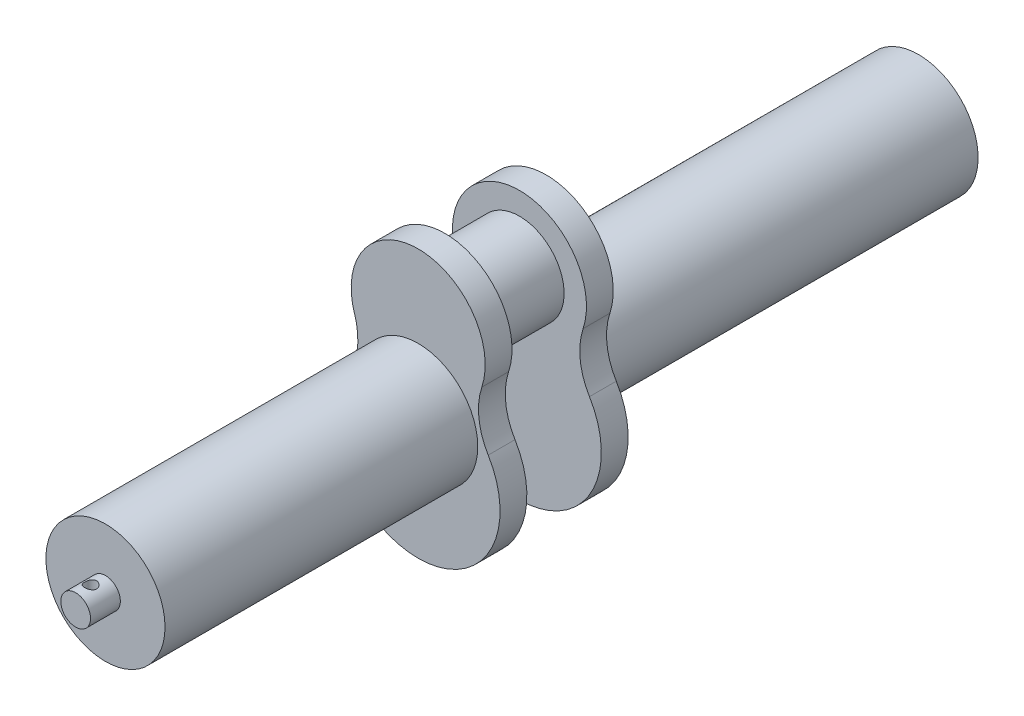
ISO-10303-21;
HEADER;
FILE_DESCRIPTION(('STEP AP214'),'2;1');
FILE_NAME('part.step','',(''),(''),'','','');
FILE_SCHEMA(('AUTOMOTIVE_DESIGN { 1 0 10303 214 1 1 1 1 }'));
ENDSEC;
DATA;
#1=APPLICATION_CONTEXT('core data for automotive mechanical design processes');
#2=APPLICATION_PROTOCOL_DEFINITION('international standard','automotive_design',2000,#1);
#3=PRODUCT_CONTEXT('',#1,'mechanical');
#4=PRODUCT('Part','Part','',(#3));
#5=PRODUCT_RELATED_PRODUCT_CATEGORY('part','',(#4));
#6=PRODUCT_DEFINITION_FORMATION('','',#4);
#7=PRODUCT_DEFINITION_CONTEXT('part definition',#1,'design');
#8=PRODUCT_DEFINITION('design','',#6,#7);
#9=PRODUCT_DEFINITION_SHAPE('','',#8);
#10=(LENGTH_UNIT() NAMED_UNIT(*) SI_UNIT(.MILLI.,.METRE.));
#11=(NAMED_UNIT(*) PLANE_ANGLE_UNIT() SI_UNIT($,.RADIAN.));
#12=(NAMED_UNIT(*) SI_UNIT($,.STERADIAN.) SOLID_ANGLE_UNIT());
#13=UNCERTAINTY_MEASURE_WITH_UNIT(LENGTH_MEASURE(1.E-05),#10,'distance_accuracy_value','');
#14=(GEOMETRIC_REPRESENTATION_CONTEXT(3) GLOBAL_UNCERTAINTY_ASSIGNED_CONTEXT((#13)) GLOBAL_UNIT_ASSIGNED_CONTEXT((#10,
#11,#12)) REPRESENTATION_CONTEXT('',''));
#15=CARTESIAN_POINT('',(0.,0.,0.));
#16=DIRECTION('',(0.,0.,1.));
#17=DIRECTION('',(1.,0.,0.));
#18=AXIS2_PLACEMENT_3D('',#15,#16,#17);
#19=CARTESIAN_POINT('',(0.,0.,273.));
#20=DIRECTION('',(0.,0.,-1.));
#21=DIRECTION('',(-1.,0.,0.));
#22=AXIS2_PLACEMENT_3D('',#19,#20,#21);
#23=CYLINDRICAL_SURFACE('',#22,10.);
#24=CARTESIAN_POINT('',(0.,0.,273.));
#25=DIRECTION('',(0.,0.,1.));
#26=DIRECTION('',(1.,0.,0.));
#27=AXIS2_PLACEMENT_3D('',#24,#25,#26);
#28=CIRCLE('',#27,10.);
#29=CARTESIAN_POINT('',(10.,0.,273.));
#30=VERTEX_POINT('',#29);
#31=EDGE_CURVE('E390',#30,#30,#28,.T.);
#32=ORIENTED_EDGE('',*,*,#31,.F.);
#33=EDGE_LOOP('',(#32));
#34=FACE_BOUND('',#33,.T.);
#35=CARTESIAN_POINT('',(0.,0.,253.));
#36=DIRECTION('',(0.,0.,1.));
#37=DIRECTION('',(1.,0.,0.));
#38=AXIS2_PLACEMENT_3D('',#35,#36,#37);
#39=CIRCLE('',#38,10.);
#40=CARTESIAN_POINT('',(10.,0.,253.));
#41=VERTEX_POINT('',#40);
#42=EDGE_CURVE('E250',#41,#41,#39,.T.);
#43=ORIENTED_EDGE('',*,*,#42,.T.);
#44=EDGE_LOOP('',(#43));
#45=FACE_BOUND('',#44,.T.);
#46=CARTESIAN_POINT('',(0.,-10.,267.));
#47=CARTESIAN_POINT('',(-0.107549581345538,-9.99999886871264,266.999998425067));
#48=CARTESIAN_POINT('',(-0.215132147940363,-9.99825999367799,266.99565632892));
#49=CARTESIAN_POINT('',(-0.429535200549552,-9.99134740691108,266.978326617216));
#50=CARTESIAN_POINT('',(-0.536355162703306,-9.98617152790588,266.965333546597));
#51=CARTESIAN_POINT('',(-0.748635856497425,-9.97250573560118,266.930791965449));
#52=CARTESIAN_POINT('',(-0.85409313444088,-9.96400865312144,266.90922494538));
#53=CARTESIAN_POINT('',(-1.0626676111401,-9.94393017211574,266.857758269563));
#54=CARTESIAN_POINT('',(-1.1657838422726,-9.932347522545,266.827855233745));
#55=CARTESIAN_POINT('',(-1.46979509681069,-9.89349112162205,266.726277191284));
#56=CARTESIAN_POINT('',(-1.66629107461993,-9.86204458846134,266.642578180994));
#57=CARTESIAN_POINT('',(-2.04217417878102,-9.79113035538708,266.44595378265));
#58=CARTESIAN_POINT('',(-2.22156721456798,-9.75166544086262,266.333038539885));
#59=CARTESIAN_POINT('',(-2.56699339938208,-9.66661825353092,266.075531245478));
#60=CARTESIAN_POINT('',(-2.73212223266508,-9.62084608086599,265.929787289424));
#61=CARTESIAN_POINT('',(-3.03635232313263,-9.52921139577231,265.613199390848));
#62=CARTESIAN_POINT('',(-3.17544084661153,-9.48334885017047,265.442343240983));
#63=CARTESIAN_POINT('',(-3.42974847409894,-9.39445587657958,265.071144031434));
#64=CARTESIAN_POINT('',(-3.54362978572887,-9.35164233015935,264.869827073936));
#65=CARTESIAN_POINT('',(-3.73550961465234,-9.2766729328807,264.448927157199));
#66=CARTESIAN_POINT('',(-3.81352517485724,-9.24451202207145,264.229352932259));
#67=CARTESIAN_POINT('',(-3.92779760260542,-9.19652715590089,263.788575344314));
#68=CARTESIAN_POINT('',(-3.96578791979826,-9.18002840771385,263.567897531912));
#69=CARTESIAN_POINT('',(-4.00434593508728,-9.16328008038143,263.122730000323));
#70=CARTESIAN_POINT('',(-4.00493203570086,-9.16302251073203,262.898242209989));
#71=CARTESIAN_POINT('',(-3.96997873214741,-9.17821000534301,262.468486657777));
#72=CARTESIAN_POINT('',(-3.93695062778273,-9.19256349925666,262.262968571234));
#73=CARTESIAN_POINT('',(-3.83989376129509,-9.23352375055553,261.86068088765));
#74=CARTESIAN_POINT('',(-3.77585958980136,-9.2601326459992,261.663912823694));
#75=CARTESIAN_POINT('',(-3.61738946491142,-9.32318970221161,261.279964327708));
#76=CARTESIAN_POINT('',(-3.5223597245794,-9.35982758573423,261.093061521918));
#77=CARTESIAN_POINT('',(-3.3050129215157,-9.43876232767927,260.73716836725));
#78=CARTESIAN_POINT('',(-3.1826856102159,-9.48106130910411,260.568184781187));
#79=CARTESIAN_POINT('',(-2.90310119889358,-9.57053473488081,260.239180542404));
#80=CARTESIAN_POINT('',(-2.7438749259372,-9.61783329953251,260.08086254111));
#81=CARTESIAN_POINT('',(-2.40062885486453,-9.70919649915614,259.792631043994));
#82=CARTESIAN_POINT('',(-2.21660413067,-9.75326048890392,259.662723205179));
#83=CARTESIAN_POINT('',(-1.82415530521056,-9.83429362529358,259.432765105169));
#84=CARTESIAN_POINT('',(-1.61532098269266,-9.87110540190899,259.333355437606));
#85=CARTESIAN_POINT('',(-1.18204753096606,-9.93229656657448,259.171664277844));
#86=CARTESIAN_POINT('',(-0.957616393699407,-9.95668226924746,259.109363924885));
#87=CARTESIAN_POINT('',(-0.513791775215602,-9.98912279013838,259.027103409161));
#88=CARTESIAN_POINT('',(-0.29488658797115,-9.99805891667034,259.004855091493));
#89=CARTESIAN_POINT('',(0.143690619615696,-10.0013695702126,258.996573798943));
#90=CARTESIAN_POINT('',(0.363362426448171,-9.99574787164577,259.010531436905));
#91=CARTESIAN_POINT('',(0.786865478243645,-9.97115134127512,259.072583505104));
#92=CARTESIAN_POINT('',(0.990964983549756,-9.95278782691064,259.119115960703));
#93=CARTESIAN_POINT('',(1.38827085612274,-9.90518882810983,259.242871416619));
#94=CARTESIAN_POINT('',(1.58147582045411,-9.87595194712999,259.320098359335));
#95=CARTESIAN_POINT('',(1.95815757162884,-9.80833189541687,259.505569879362));
#96=CARTESIAN_POINT('',(2.14115604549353,-9.76969631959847,259.614690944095));
#97=CARTESIAN_POINT('',(2.4868871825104,-9.68746729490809,259.859880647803));
#98=CARTESIAN_POINT('',(2.64961168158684,-9.64387186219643,259.995960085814));
#99=CARTESIAN_POINT('',(2.96144608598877,-9.55290235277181,260.301740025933));
#100=CARTESIAN_POINT('',(3.10894786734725,-9.50546882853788,260.473067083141));
#101=CARTESIAN_POINT('',(3.37350239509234,-9.41483345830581,260.83888016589));
#102=CARTESIAN_POINT('',(3.49055012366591,-9.37163231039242,261.033370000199));
#103=CARTESIAN_POINT('',(3.69161500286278,-9.29428599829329,261.442923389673));
#104=CARTESIAN_POINT('',(3.77530118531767,-9.2602326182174,261.658168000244));
#105=CARTESIAN_POINT('',(3.90459244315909,-9.20647346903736,262.101467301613));
#106=CARTESIAN_POINT('',(3.95022562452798,-9.1867571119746,262.329512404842));
#107=CARTESIAN_POINT('',(3.99943122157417,-9.16543518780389,262.774255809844));
#108=CARTESIAN_POINT('',(4.00579411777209,-9.16262842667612,262.990589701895));
#109=CARTESIAN_POINT('',(3.98360636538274,-9.17229671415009,263.421089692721));
#110=CARTESIAN_POINT('',(3.9550601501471,-9.18476982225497,263.635256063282));
#111=CARTESIAN_POINT('',(3.8661425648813,-9.2225330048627,264.04666446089));
#112=CARTESIAN_POINT('',(3.80707437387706,-9.2472967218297,264.244240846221));
#113=CARTESIAN_POINT('',(3.66001151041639,-9.30647993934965,264.62675696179));
#114=CARTESIAN_POINT('',(3.57200884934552,-9.34090210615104,264.811693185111));
#115=CARTESIAN_POINT('',(3.36374310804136,-9.4179725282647,265.175220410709));
#116=CARTESIAN_POINT('',(3.24192140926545,-9.46097893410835,265.352841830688));
#117=CARTESIAN_POINT('',(2.97179350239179,-9.5492747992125,265.685982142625));
#118=CARTESIAN_POINT('',(2.82347931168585,-9.5945649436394,265.84149434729));
#119=CARTESIAN_POINT('',(2.49297412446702,-9.68587647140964,266.136423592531));
#120=CARTESIAN_POINT('',(2.30921017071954,-9.73175488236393,266.274143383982));
#121=CARTESIAN_POINT('',(2.01716584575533,-9.7949502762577,266.456048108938));
#122=CARTESIAN_POINT('',(1.91699501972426,-9.81509269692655,266.512607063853));
#123=CARTESIAN_POINT('',(1.71180110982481,-9.85294835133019,266.617037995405));
#124=CARTESIAN_POINT('',(1.60678027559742,-9.87066269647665,266.664913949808));
#125=CARTESIAN_POINT('',(1.39454646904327,-9.9028559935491,266.750747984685));
#126=CARTESIAN_POINT('',(1.28740777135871,-9.91738778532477,266.788870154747));
#127=CARTESIAN_POINT('',(1.06995577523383,-9.94319722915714,266.855921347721));
#128=CARTESIAN_POINT('',(0.959643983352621,-9.95447639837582,266.88485465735));
#129=CARTESIAN_POINT('',(0.736945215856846,-9.97343330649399,266.933174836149));
#130=CARTESIAN_POINT('',(0.624564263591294,-9.98112017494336,266.952585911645));
#131=CARTESIAN_POINT('',(0.398419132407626,-9.99270031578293,266.981738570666));
#132=CARTESIAN_POINT('',(0.284655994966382,-9.99659628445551,266.991487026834));
#133=CARTESIAN_POINT('',(0.113830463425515,-9.99951445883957,266.998785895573));
#134=CARTESIAN_POINT('',(0.0569198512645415,-10.0000005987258,267.000000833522));
#135=CARTESIAN_POINT('',(0.,-10.,267.));
#136=B_SPLINE_CURVE_WITH_KNOTS('',3,(#46,#47,#48,#49,#50,#51,#52,#53,#54,#55,#56,#57,#58,#59,
#60,#61,#62,#63,#64,#65,#66,#67,#68,#69,#70,#71,#72,#73,#74,#75,#76,#77,#78,#79,#80,#81,#82,#83,
#84,#85,#86,#87,#88,#89,#90,#91,#92,#93,#94,#95,#96,#97,#98,#99,#100,#101,#102,#103,#104,#105,
#106,#107,#108,#109,#110,#111,#112,#113,#114,#115,#116,#117,#118,#119,#120,#121,#122,#123,#124,
#125,#126,#127,#128,#129,#130,#131,#132,#133,#134,#135),.UNSPECIFIED.,.T.,.F.,(4,2,2,2,2,2,2,2,
2,2,2,2,2,2,2,2,2,2,2,2,2,2,2,2,2,2,2,2,2,2,2,2,2,2,2,2,2,2,2,2,2,2,2,2,4),(0.,
0.322603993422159,0.645411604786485,0.968919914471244,1.29255959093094,1.93701523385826,
2.58124739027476,3.25313995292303,3.92536021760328,4.62749749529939,5.32930078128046,
5.99927442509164,6.66891844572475,7.29195888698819,7.91510806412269,8.55097484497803,
9.18708075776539,9.87235930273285,10.5577741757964,11.2567305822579,11.9553314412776,
12.6125760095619,13.2696501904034,13.8972014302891,14.5248332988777,15.171662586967,
15.8187515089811,16.50856181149,17.1984856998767,17.8950932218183,18.5911857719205,
19.2371857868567,19.8831037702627,20.5034786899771,21.1240250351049,21.7801016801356,
22.4363763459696,23.1352007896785,23.4851924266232,23.8350233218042,24.1785111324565,
24.52183846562,24.8642884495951,25.2064946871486,25.3772305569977),.UNSPECIFIED.);
#137=CARTESIAN_POINT('',(0.,-10.,267.));
#138=VERTEX_POINT('',#137);
#139=EDGE_CURVE('E386',#138,#138,#136,.T.);
#140=ORIENTED_EDGE('',*,*,#139,.F.);
#141=EDGE_LOOP('',(#140));
#142=FACE_BOUND('',#141,.T.);
#143=CARTESIAN_POINT('',(0.,10.,259.));
#144=CARTESIAN_POINT('',(0.107549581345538,9.99999886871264,259.000001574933));
#145=CARTESIAN_POINT('',(0.215132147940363,9.99825999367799,259.00434367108));
#146=CARTESIAN_POINT('',(0.429535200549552,9.99134740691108,259.021673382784));
#147=CARTESIAN_POINT('',(0.536355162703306,9.98617152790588,259.034666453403));
#148=CARTESIAN_POINT('',(0.748635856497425,9.97250573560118,259.069208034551));
#149=CARTESIAN_POINT('',(0.85409313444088,9.96400865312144,259.09077505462));
#150=CARTESIAN_POINT('',(1.0626676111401,9.94393017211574,259.142241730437));
#151=CARTESIAN_POINT('',(1.1657838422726,9.932347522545,259.172144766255));
#152=CARTESIAN_POINT('',(1.46979509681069,9.89349112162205,259.273722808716));
#153=CARTESIAN_POINT('',(1.66629107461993,9.86204458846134,259.357421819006));
#154=CARTESIAN_POINT('',(2.04217417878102,9.79113035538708,259.55404621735));
#155=CARTESIAN_POINT('',(2.22156721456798,9.75166544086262,259.666961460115));
#156=CARTESIAN_POINT('',(2.56699339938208,9.66661825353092,259.924468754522));
#157=CARTESIAN_POINT('',(2.73212223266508,9.62084608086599,260.070212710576));
#158=CARTESIAN_POINT('',(3.03635232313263,9.52921139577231,260.386800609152));
#159=CARTESIAN_POINT('',(3.17544084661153,9.48334885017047,260.557656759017));
#160=CARTESIAN_POINT('',(3.42974847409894,9.39445587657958,260.928855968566));
#161=CARTESIAN_POINT('',(3.54362978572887,9.35164233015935,261.130172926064));
#162=CARTESIAN_POINT('',(3.73550961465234,9.2766729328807,261.551072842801));
#163=CARTESIAN_POINT('',(3.81352517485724,9.24451202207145,261.770647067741));
#164=CARTESIAN_POINT('',(3.92779760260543,9.19652715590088,262.211424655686));
#165=CARTESIAN_POINT('',(3.96578791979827,9.18002840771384,262.432102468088));
#166=CARTESIAN_POINT('',(4.00434593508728,9.16328008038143,262.877269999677));
#167=CARTESIAN_POINT('',(4.00493203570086,9.16302251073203,263.101757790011));
#168=CARTESIAN_POINT('',(3.96997873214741,9.17821000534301,263.531513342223));
#169=CARTESIAN_POINT('',(3.93695062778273,9.19256349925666,263.737031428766));
#170=CARTESIAN_POINT('',(3.83989376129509,9.23352375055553,264.13931911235));
#171=CARTESIAN_POINT('',(3.77585958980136,9.2601326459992,264.336087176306));
#172=CARTESIAN_POINT('',(3.61738946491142,9.32318970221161,264.720035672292));
#173=CARTESIAN_POINT('',(3.5223597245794,9.35982758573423,264.906938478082));
#174=CARTESIAN_POINT('',(3.3050129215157,9.43876232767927,265.26283163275));
#175=CARTESIAN_POINT('',(3.1826856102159,9.48106130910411,265.431815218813));
#176=CARTESIAN_POINT('',(2.90310119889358,9.57053473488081,265.760819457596));
#177=CARTESIAN_POINT('',(2.7438749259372,9.61783329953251,265.91913745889));
#178=CARTESIAN_POINT('',(2.40062885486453,9.70919649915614,266.207368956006));
#179=CARTESIAN_POINT('',(2.21660413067,9.75326048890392,266.337276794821));
#180=CARTESIAN_POINT('',(1.82415530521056,9.83429362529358,266.567234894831));
#181=CARTESIAN_POINT('',(1.61532098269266,9.87110540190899,266.666644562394));
#182=CARTESIAN_POINT('',(1.18204753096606,9.93229656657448,266.828335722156));
#183=CARTESIAN_POINT('',(0.957616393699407,9.95668226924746,266.890636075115));
#184=CARTESIAN_POINT('',(0.513791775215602,9.98912279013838,266.972896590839));
#185=CARTESIAN_POINT('',(0.29488658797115,9.99805891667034,266.995144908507));
#186=CARTESIAN_POINT('',(-0.143690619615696,10.0013695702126,267.003426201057));
#187=CARTESIAN_POINT('',(-0.363362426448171,9.99574787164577,266.989468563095));
#188=CARTESIAN_POINT('',(-0.786865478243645,9.97115134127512,266.927416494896));
#189=CARTESIAN_POINT('',(-0.990964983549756,9.95278782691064,266.880884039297));
#190=CARTESIAN_POINT('',(-1.38827085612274,9.90518882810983,266.757128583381));
#191=CARTESIAN_POINT('',(-1.58147582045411,9.87595194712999,266.679901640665));
#192=CARTESIAN_POINT('',(-1.95815757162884,9.80833189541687,266.494430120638));
#193=CARTESIAN_POINT('',(-2.14115604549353,9.76969631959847,266.385309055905));
#194=CARTESIAN_POINT('',(-2.4868871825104,9.68746729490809,266.140119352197));
#195=CARTESIAN_POINT('',(-2.64961168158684,9.64387186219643,266.004039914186));
#196=CARTESIAN_POINT('',(-2.96144608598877,9.55290235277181,265.698259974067));
#197=CARTESIAN_POINT('',(-3.10894786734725,9.50546882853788,265.526932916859));
#198=CARTESIAN_POINT('',(-3.37350239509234,9.41483345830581,265.16111983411));
#199=CARTESIAN_POINT('',(-3.49055012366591,9.37163231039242,264.966629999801));
#200=CARTESIAN_POINT('',(-3.69161500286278,9.29428599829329,264.557076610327));
#201=CARTESIAN_POINT('',(-3.77530118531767,9.2602326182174,264.341831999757));
#202=CARTESIAN_POINT('',(-3.90459244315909,9.20647346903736,263.898532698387));
#203=CARTESIAN_POINT('',(-3.95022562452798,9.1867571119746,263.670487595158));
#204=CARTESIAN_POINT('',(-3.99943122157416,9.16543518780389,263.225744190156));
#205=CARTESIAN_POINT('',(-4.00579411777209,9.16262842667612,263.009410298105));
#206=CARTESIAN_POINT('',(-3.98360636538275,9.17229671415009,262.578910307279));
#207=CARTESIAN_POINT('',(-3.95506015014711,9.18476982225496,262.364743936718));
#208=CARTESIAN_POINT('',(-3.8661425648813,9.2225330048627,261.95333553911));
#209=CARTESIAN_POINT('',(-3.80707437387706,9.2472967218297,261.755759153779));
#210=CARTESIAN_POINT('',(-3.66001151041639,9.30647993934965,261.37324303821));
#211=CARTESIAN_POINT('',(-3.57200884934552,9.34090210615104,261.188306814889));
#212=CARTESIAN_POINT('',(-3.36374310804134,9.4179725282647,260.824779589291));
#213=CARTESIAN_POINT('',(-3.24192140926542,9.46097893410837,260.647158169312));
#214=CARTESIAN_POINT('',(-2.97179350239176,9.54927479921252,260.314017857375));
#215=CARTESIAN_POINT('',(-2.82347931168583,9.59456494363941,260.15850565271));
#216=CARTESIAN_POINT('',(-2.49297412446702,9.68587647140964,259.863576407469));
#217=CARTESIAN_POINT('',(-2.30921017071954,9.73175488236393,259.725856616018));
#218=CARTESIAN_POINT('',(-2.01716584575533,9.7949502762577,259.543951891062));
#219=CARTESIAN_POINT('',(-1.91699501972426,9.81509269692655,259.487392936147));
#220=CARTESIAN_POINT('',(-1.71180110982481,9.85294835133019,259.382962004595));
#221=CARTESIAN_POINT('',(-1.60678027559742,9.87066269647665,259.335086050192));
#222=CARTESIAN_POINT('',(-1.39454646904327,9.9028559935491,259.249252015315));
#223=CARTESIAN_POINT('',(-1.28740777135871,9.91738778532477,259.211129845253));
#224=CARTESIAN_POINT('',(-1.06995577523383,9.94319722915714,259.144078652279));
#225=CARTESIAN_POINT('',(-0.959643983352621,9.95447639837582,259.11514534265));
#226=CARTESIAN_POINT('',(-0.736945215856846,9.97343330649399,259.066825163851));
#227=CARTESIAN_POINT('',(-0.624564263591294,9.98112017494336,259.047414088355));
#228=CARTESIAN_POINT('',(-0.398419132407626,9.99270031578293,259.018261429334));
#229=CARTESIAN_POINT('',(-0.284655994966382,9.99659628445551,259.008512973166));
#230=CARTESIAN_POINT('',(-0.113830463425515,9.99951445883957,259.001214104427));
#231=CARTESIAN_POINT('',(-0.0569198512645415,10.0000005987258,258.999999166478));
#232=CARTESIAN_POINT('',(0.,10.,259.));
#233=B_SPLINE_CURVE_WITH_KNOTS('',3,(#143,#144,#145,#146,#147,#148,#149,#150,#151,#152,#153,
#154,#155,#156,#157,#158,#159,#160,#161,#162,#163,#164,#165,#166,#167,#168,#169,#170,#171,#172,
#173,#174,#175,#176,#177,#178,#179,#180,#181,#182,#183,#184,#185,#186,#187,#188,#189,#190,#191,
#192,#193,#194,#195,#196,#197,#198,#199,#200,#201,#202,#203,#204,#205,#206,#207,#208,#209,#210,
#211,#212,#213,#214,#215,#216,#217,#218,#219,#220,#221,#222,#223,#224,#225,#226,#227,#228,#229,
#230,#231,#232),.UNSPECIFIED.,.T.,.F.,(4,2,2,2,2,2,2,2,2,2,2,2,2,2,2,2,2,2,2,2,2,2,2,2,2,2,2,2,
2,2,2,2,2,2,2,2,2,2,2,2,2,2,2,2,4),(0.,0.322603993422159,0.645411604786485,0.968919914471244,
1.29255959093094,1.93701523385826,2.58124739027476,3.25313995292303,3.92536021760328,
4.62749749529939,5.32930078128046,5.99927442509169,6.66891844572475,7.29195888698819,
7.91510806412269,8.55097484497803,9.18708075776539,9.87235930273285,10.5577741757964,
11.2567305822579,11.9553314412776,12.6125760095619,13.2696501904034,13.8972014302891,
14.5248332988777,15.171662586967,15.8187515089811,16.50856181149,17.1984856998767,
17.8950932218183,18.5911857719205,19.2371857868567,19.8831037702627,20.5034786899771,
21.1240250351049,21.7801016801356,22.4363763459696,23.1352007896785,23.4851924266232,
23.8350233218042,24.1785111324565,24.52183846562,24.8642884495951,25.2064946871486,
25.3772305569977),.UNSPECIFIED.);
#234=CARTESIAN_POINT('',(0.,10.,259.));
#235=VERTEX_POINT('',#234);
#236=EDGE_CURVE('E380',#235,#235,#233,.T.);
#237=ORIENTED_EDGE('',*,*,#236,.T.);
#238=EDGE_LOOP('',(#237));
#239=FACE_BOUND('',#238,.T.);
#240=ADVANCED_FACE('F32',(#34,#45,#142,#239),#23,.T.);
#241=CARTESIAN_POINT('',(0.,50.,25.));
#242=DIRECTION('',(0.,0.,-1.));
#243=DIRECTION('',(-1.,0.,0.));
#244=AXIS2_PLACEMENT_3D('',#241,#242,#243);
#245=CYLINDRICAL_SURFACE('',#244,30.);
#246=CARTESIAN_POINT('',(0.,50.,25.));
#247=DIRECTION('',(0.,0.,1.));
#248=DIRECTION('',(1.,0.,0.));
#249=AXIS2_PLACEMENT_3D('',#246,#247,#248);
#250=CIRCLE('',#249,30.);
#251=CARTESIAN_POINT('',(30.,50.,25.));
#252=VERTEX_POINT('',#251);
#253=EDGE_CURVE('E11',#252,#252,#250,.T.);
#254=ORIENTED_EDGE('',*,*,#253,.F.);
#255=EDGE_LOOP('',(#254));
#256=FACE_BOUND('',#255,.T.);
#257=CARTESIAN_POINT('',(0.,50.,-25.));
#258=DIRECTION('',(0.,0.,-1.));
#259=DIRECTION('',(-1.,0.,0.));
#260=AXIS2_PLACEMENT_3D('',#257,#258,#259);
#261=CIRCLE('',#260,30.);
#262=CARTESIAN_POINT('',(-30.,50.,-25.));
#263=VERTEX_POINT('',#262);
#264=EDGE_CURVE('E119',#263,#263,#261,.T.);
#265=ORIENTED_EDGE('',*,*,#264,.F.);
#266=EDGE_LOOP('',(#265));
#267=FACE_BOUND('',#266,.T.);
#268=ADVANCED_FACE('F34',(#256,#267),#245,.T.);
#269=CARTESIAN_POINT('',(-85.492598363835,21.875,43.));
#270=DIRECTION('',(0.,0.,-1.));
#271=DIRECTION('',(-1.,0.,0.));
#272=AXIS2_PLACEMENT_3D('',#269,#270,#271);
#273=CYLINDRICAL_SURFACE('',#272,45.);
#274=CARTESIAN_POINT('',(-85.492598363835,21.875,25.));
#275=DIRECTION('',(0.,0.,-1.));
#276=DIRECTION('',(1.,0.,0.));
#277=AXIS2_PLACEMENT_3D('',#274,#275,#276);
#278=CIRCLE('',#277,45.);
#279=CARTESIAN_POINT('',(-42.7462991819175,35.9375,25.));
#280=VERTEX_POINT('',#279);
#281=CARTESIAN_POINT('',(-47.0209291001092,-1.46874999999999,25.));
#282=VERTEX_POINT('',#281);
#283=EDGE_CURVE('E159',#280,#282,#278,.T.);
#284=ORIENTED_EDGE('',*,*,#283,.T.);
#285=DIRECTION('',(0.,0.,-1.));
#286=VECTOR('',#285,1.);
#287=CARTESIAN_POINT('',(-47.0209291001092,-1.46874999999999,43.));
#288=LINE('',#287,#286);
#289=CARTESIAN_POINT('',(-47.0209291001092,-1.46874999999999,43.));
#290=VERTEX_POINT('',#289);
#291=EDGE_CURVE('E41',#290,#282,#288,.T.);
#292=ORIENTED_EDGE('',*,*,#291,.F.);
#293=CARTESIAN_POINT('',(-85.492598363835,21.875,43.));
#294=DIRECTION('',(0.,0.,-1.));
#295=DIRECTION('',(1.,0.,0.));
#296=AXIS2_PLACEMENT_3D('',#293,#294,#295);
#297=CIRCLE('',#296,45.);
#298=CARTESIAN_POINT('',(-42.7462991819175,35.9375,43.));
#299=VERTEX_POINT('',#298);
#300=EDGE_CURVE('E162',#299,#290,#297,.T.);
#301=ORIENTED_EDGE('',*,*,#300,.F.);
#302=DIRECTION('',(0.,0.,-1.));
#303=VECTOR('',#302,1.);
#304=CARTESIAN_POINT('',(-42.7462991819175,35.9375,43.));
#305=LINE('',#304,#303);
#306=EDGE_CURVE('E168',#299,#280,#305,.T.);
#307=ORIENTED_EDGE('',*,*,#306,.T.);
#308=EDGE_LOOP('',(#284,#292,#301,#307));
#309=FACE_BOUND('',#308,.T.);
#310=ADVANCED_FACE('F184',(#309),#273,.F.);
#311=CARTESIAN_POINT('',(0.,-30.,43.));
#312=DIRECTION('',(0.,0.,-1.));
#313=DIRECTION('',(-1.,0.,0.));
#314=AXIS2_PLACEMENT_3D('',#311,#312,#313);
#315=CYLINDRICAL_SURFACE('',#314,55.);
#316=CARTESIAN_POINT('',(0.,-30.,25.));
#317=DIRECTION('',(0.,0.,1.));
#318=DIRECTION('',(1.,0.,0.));
#319=AXIS2_PLACEMENT_3D('',#316,#317,#318);
#320=CIRCLE('',#319,55.);
#321=CARTESIAN_POINT('',(47.0209291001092,-1.46875,25.));
#322=VERTEX_POINT('',#321);
#323=EDGE_CURVE('E171',#282,#322,#320,.T.);
#324=ORIENTED_EDGE('',*,*,#323,.T.);
#325=DIRECTION('',(0.,0.,-1.));
#326=VECTOR('',#325,1.);
#327=CARTESIAN_POINT('',(47.0209291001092,-1.46875,43.));
#328=LINE('',#327,#326);
#329=CARTESIAN_POINT('',(47.0209291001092,-1.46875,43.));
#330=VERTEX_POINT('',#329);
#331=EDGE_CURVE('E178',#330,#322,#328,.T.);
#332=ORIENTED_EDGE('',*,*,#331,.F.);
#333=CARTESIAN_POINT('',(0.,-30.,43.));
#334=DIRECTION('',(0.,0.,1.));
#335=DIRECTION('',(1.,0.,0.));
#336=AXIS2_PLACEMENT_3D('',#333,#334,#335);
#337=CIRCLE('',#336,55.);
#338=EDGE_CURVE('E81',#290,#330,#337,.T.);
#339=ORIENTED_EDGE('',*,*,#338,.F.);
#340=ORIENTED_EDGE('',*,*,#291,.T.);
#341=EDGE_LOOP('',(#324,#332,#339,#340));
#342=FACE_BOUND('',#341,.T.);
#343=ADVANCED_FACE('F180',(#342),#315,.T.);
#344=CARTESIAN_POINT('',(85.492598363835,21.875,43.));
#345=DIRECTION('',(0.,0.,-1.));
#346=DIRECTION('',(-1.,0.,0.));
#347=AXIS2_PLACEMENT_3D('',#344,#345,#346);
#348=CYLINDRICAL_SURFACE('',#347,45.);
#349=CARTESIAN_POINT('',(85.492598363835,21.875,25.));
#350=DIRECTION('',(0.,0.,-1.));
#351=DIRECTION('',(-1.,0.,0.));
#352=AXIS2_PLACEMENT_3D('',#349,#350,#351);
#353=CIRCLE('',#352,45.);
#354=CARTESIAN_POINT('',(42.7462991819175,35.9375,25.));
#355=VERTEX_POINT('',#354);
#356=EDGE_CURVE('E67',#322,#355,#353,.T.);
#357=ORIENTED_EDGE('',*,*,#356,.T.);
#358=DIRECTION('',(0.,0.,-1.));
#359=VECTOR('',#358,1.);
#360=CARTESIAN_POINT('',(42.7462991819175,35.9375,43.));
#361=LINE('',#360,#359);
#362=CARTESIAN_POINT('',(42.7462991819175,35.9375,43.));
#363=VERTEX_POINT('',#362);
#364=EDGE_CURVE('E176',#363,#355,#361,.T.);
#365=ORIENTED_EDGE('',*,*,#364,.F.);
#366=CARTESIAN_POINT('',(85.492598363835,21.875,43.));
#367=DIRECTION('',(0.,0.,-1.));
#368=DIRECTION('',(-1.,0.,0.));
#369=AXIS2_PLACEMENT_3D('',#366,#367,#368);
#370=CIRCLE('',#369,45.);
#371=EDGE_CURVE('E165',#330,#363,#370,.T.);
#372=ORIENTED_EDGE('',*,*,#371,.F.);
#373=ORIENTED_EDGE('',*,*,#331,.T.);
#374=EDGE_LOOP('',(#357,#365,#372,#373));
#375=FACE_BOUND('',#374,.T.);
#376=ADVANCED_FACE('F255',(#375),#348,.F.);
#377=CARTESIAN_POINT('',(0.,50.,43.));
#378=DIRECTION('',(0.,0.,-1.));
#379=DIRECTION('',(-1.,0.,0.));
#380=AXIS2_PLACEMENT_3D('',#377,#378,#379);
#381=CYLINDRICAL_SURFACE('',#380,45.);
#382=CARTESIAN_POINT('',(0.,50.,25.));
#383=DIRECTION('',(0.,0.,1.));
#384=DIRECTION('',(1.,0.,0.));
#385=AXIS2_PLACEMENT_3D('',#382,#383,#384);
#386=CIRCLE('',#385,45.);
#387=EDGE_CURVE('E73',#355,#280,#386,.T.);
#388=ORIENTED_EDGE('',*,*,#387,.T.);
#389=ORIENTED_EDGE('',*,*,#306,.F.);
#390=CARTESIAN_POINT('',(0.,50.,43.));
#391=DIRECTION('',(0.,0.,1.));
#392=DIRECTION('',(1.,0.,0.));
#393=AXIS2_PLACEMENT_3D('',#390,#391,#392);
#394=CIRCLE('',#393,45.);
#395=EDGE_CURVE('E49',#363,#299,#394,.T.);
#396=ORIENTED_EDGE('',*,*,#395,.F.);
#397=ORIENTED_EDGE('',*,*,#364,.T.);
#398=EDGE_LOOP('',(#388,#389,#396,#397));
#399=FACE_BOUND('',#398,.T.);
#400=ADVANCED_FACE('F199',(#399),#381,.T.);
#401=CARTESIAN_POINT('',(-42.7462991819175,35.9375,43.));
#402=DIRECTION('',(0.,0.,1.));
#403=DIRECTION('',(1.,0.,0.));
#404=AXIS2_PLACEMENT_3D('',#401,#402,#403);
#405=PLANE('',#404);
#406=CARTESIAN_POINT('',(0.,0.,43.));
#407=DIRECTION('',(0.,0.,1.));
#408=DIRECTION('',(1.,0.,0.));
#409=AXIS2_PLACEMENT_3D('',#406,#407,#408);
#410=CIRCLE('',#409,40.);
#411=CARTESIAN_POINT('',(40.,0.,43.));
#412=VERTEX_POINT('',#411);
#413=EDGE_CURVE('E155',#412,#412,#410,.T.);
#414=ORIENTED_EDGE('',*,*,#413,.F.);
#415=EDGE_LOOP('',(#414));
#416=FACE_BOUND('',#415,.T.);
#417=ORIENTED_EDGE('',*,*,#300,.T.);
#418=ORIENTED_EDGE('',*,*,#338,.T.);
#419=ORIENTED_EDGE('',*,*,#371,.T.);
#420=ORIENTED_EDGE('',*,*,#395,.T.);
#421=EDGE_LOOP('',(#417,#418,#419,#420));
#422=FACE_BOUND('',#421,.T.);
#423=ADVANCED_FACE('F189',(#416,#422),#405,.T.);
#424=CARTESIAN_POINT('',(-42.7462991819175,35.9375,25.));
#425=DIRECTION('',(0.,0.,1.));
#426=DIRECTION('',(1.,0.,0.));
#427=AXIS2_PLACEMENT_3D('',#424,#425,#426);
#428=PLANE('',#427);
#429=ORIENTED_EDGE('',*,*,#253,.T.);
#430=EDGE_LOOP('',(#429));
#431=FACE_BOUND('',#430,.T.);
#432=ORIENTED_EDGE('',*,*,#283,.F.);
#433=ORIENTED_EDGE('',*,*,#387,.F.);
#434=ORIENTED_EDGE('',*,*,#356,.F.);
#435=ORIENTED_EDGE('',*,*,#323,.F.);
#436=EDGE_LOOP('',(#432,#433,#434,#435));
#437=FACE_BOUND('',#436,.T.);
#438=ADVANCED_FACE('F186',(#431,#437),#428,.F.);
#439=CARTESIAN_POINT('',(0.,0.,253.));
#440=DIRECTION('',(0.,0.,-1.));
#441=DIRECTION('',(-1.,0.,0.));
#442=AXIS2_PLACEMENT_3D('',#439,#440,#441);
#443=CYLINDRICAL_SURFACE('',#442,40.);
#444=CARTESIAN_POINT('',(0.,0.,253.));
#445=DIRECTION('',(0.,0.,1.));
#446=DIRECTION('',(1.,0.,0.));
#447=AXIS2_PLACEMENT_3D('',#444,#445,#446);
#448=CIRCLE('',#447,40.);
#449=CARTESIAN_POINT('',(40.,0.,253.));
#450=VERTEX_POINT('',#449);
#451=EDGE_CURVE('E156',#450,#450,#448,.T.);
#452=ORIENTED_EDGE('',*,*,#451,.F.);
#453=EDGE_LOOP('',(#452));
#454=FACE_BOUND('',#453,.T.);
#455=ORIENTED_EDGE('',*,*,#413,.T.);
#456=EDGE_LOOP('',(#455));
#457=FACE_BOUND('',#456,.T.);
#458=ADVANCED_FACE('F188',(#454,#457),#443,.T.);
#459=CARTESIAN_POINT('',(0.,0.,253.));
#460=DIRECTION('',(0.,0.,1.));
#461=DIRECTION('',(1.,0.,0.));
#462=AXIS2_PLACEMENT_3D('',#459,#460,#461);
#463=PLANE('',#462);
#464=ORIENTED_EDGE('',*,*,#42,.F.);
#465=EDGE_LOOP('',(#464));
#466=FACE_BOUND('',#465,.T.);
#467=ORIENTED_EDGE('',*,*,#451,.T.);
#468=EDGE_LOOP('',(#467));
#469=FACE_BOUND('',#468,.T.);
#470=ADVANCED_FACE('F196',(#466,#469),#463,.T.);
#471=CARTESIAN_POINT('',(-85.492598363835,21.875,-43.));
#472=DIRECTION('',(0.,0.,1.));
#473=DIRECTION('',(1.,0.,0.));
#474=AXIS2_PLACEMENT_3D('',#471,#472,#473);
#475=CYLINDRICAL_SURFACE('',#474,45.);
#476=CARTESIAN_POINT('',(-85.492598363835,21.875,-25.));
#477=DIRECTION('',(0.,0.,-1.));
#478=DIRECTION('',(1.,0.,0.));
#479=AXIS2_PLACEMENT_3D('',#476,#477,#478);
#480=CIRCLE('',#479,45.);
#481=CARTESIAN_POINT('',(-42.7462991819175,35.9375,-25.));
#482=VERTEX_POINT('',#481);
#483=CARTESIAN_POINT('',(-47.0209291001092,-1.46874999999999,-25.));
#484=VERTEX_POINT('',#483);
#485=EDGE_CURVE('E114',#482,#484,#480,.T.);
#486=ORIENTED_EDGE('',*,*,#485,.F.);
#487=DIRECTION('',(0.,0.,1.));
#488=VECTOR('',#487,1.);
#489=CARTESIAN_POINT('',(-42.7462991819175,35.9375,-43.));
#490=LINE('',#489,#488);
#491=CARTESIAN_POINT('',(-42.7462991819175,35.9375,-43.));
#492=VERTEX_POINT('',#491);
#493=EDGE_CURVE('E108',#492,#482,#490,.T.);
#494=ORIENTED_EDGE('',*,*,#493,.F.);
#495=CARTESIAN_POINT('',(-85.492598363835,21.875,-43.));
#496=DIRECTION('',(0.,0.,-1.));
#497=DIRECTION('',(1.,0.,0.));
#498=AXIS2_PLACEMENT_3D('',#495,#496,#497);
#499=CIRCLE('',#498,45.);
#500=CARTESIAN_POINT('',(-47.0209291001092,-1.46874999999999,-43.));
#501=VERTEX_POINT('',#500);
#502=EDGE_CURVE('E111',#492,#501,#499,.T.);
#503=ORIENTED_EDGE('',*,*,#502,.T.);
#504=DIRECTION('',(0.,0.,1.));
#505=VECTOR('',#504,1.);
#506=CARTESIAN_POINT('',(-47.0209291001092,-1.46874999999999,-43.));
#507=LINE('',#506,#505);
#508=EDGE_CURVE('E139',#501,#484,#507,.T.);
#509=ORIENTED_EDGE('',*,*,#508,.T.);
#510=EDGE_LOOP('',(#486,#494,#503,#509));
#511=FACE_BOUND('',#510,.T.);
#512=ADVANCED_FACE('F110',(#511),#475,.F.);
#513=CARTESIAN_POINT('',(0.,50.,-43.));
#514=DIRECTION('',(0.,0.,1.));
#515=DIRECTION('',(1.,0.,0.));
#516=AXIS2_PLACEMENT_3D('',#513,#514,#515);
#517=CYLINDRICAL_SURFACE('',#516,45.);
#518=CARTESIAN_POINT('',(0.,50.,-25.));
#519=DIRECTION('',(0.,0.,1.));
#520=DIRECTION('',(1.,0.,0.));
#521=AXIS2_PLACEMENT_3D('',#518,#519,#520);
#522=CIRCLE('',#521,45.);
#523=CARTESIAN_POINT('',(42.7462991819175,35.9375,-25.));
#524=VERTEX_POINT('',#523);
#525=EDGE_CURVE('E141',#524,#482,#522,.T.);
#526=ORIENTED_EDGE('',*,*,#525,.F.);
#527=DIRECTION('',(0.,0.,1.));
#528=VECTOR('',#527,1.);
#529=CARTESIAN_POINT('',(42.7462991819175,35.9375,-43.));
#530=LINE('',#529,#528);
#531=CARTESIAN_POINT('',(42.7462991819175,35.9375,-43.));
#532=VERTEX_POINT('',#531);
#533=EDGE_CURVE('E120',#532,#524,#530,.T.);
#534=ORIENTED_EDGE('',*,*,#533,.F.);
#535=CARTESIAN_POINT('',(0.,50.,-43.));
#536=DIRECTION('',(0.,0.,1.));
#537=DIRECTION('',(1.,0.,0.));
#538=AXIS2_PLACEMENT_3D('',#535,#536,#537);
#539=CIRCLE('',#538,45.);
#540=EDGE_CURVE('E126',#532,#492,#539,.T.);
#541=ORIENTED_EDGE('',*,*,#540,.T.);
#542=ORIENTED_EDGE('',*,*,#493,.T.);
#543=EDGE_LOOP('',(#526,#534,#541,#542));
#544=FACE_BOUND('',#543,.T.);
#545=ADVANCED_FACE('F132',(#544),#517,.T.);
#546=CARTESIAN_POINT('',(85.492598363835,21.875,-43.));
#547=DIRECTION('',(0.,0.,1.));
#548=DIRECTION('',(1.,0.,0.));
#549=AXIS2_PLACEMENT_3D('',#546,#547,#548);
#550=CYLINDRICAL_SURFACE('',#549,45.);
#551=CARTESIAN_POINT('',(85.492598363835,21.875,-25.));
#552=DIRECTION('',(0.,0.,-1.));
#553=DIRECTION('',(-1.,0.,0.));
#554=AXIS2_PLACEMENT_3D('',#551,#552,#553);
#555=CIRCLE('',#554,45.);
#556=CARTESIAN_POINT('',(47.0209291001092,-1.46875,-25.));
#557=VERTEX_POINT('',#556);
#558=EDGE_CURVE('E144',#557,#524,#555,.T.);
#559=ORIENTED_EDGE('',*,*,#558,.F.);
#560=DIRECTION('',(0.,0.,1.));
#561=VECTOR('',#560,1.);
#562=CARTESIAN_POINT('',(47.0209291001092,-1.46875,-43.));
#563=LINE('',#562,#561);
#564=CARTESIAN_POINT('',(47.0209291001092,-1.46875,-43.));
#565=VERTEX_POINT('',#564);
#566=EDGE_CURVE('E150',#565,#557,#563,.T.);
#567=ORIENTED_EDGE('',*,*,#566,.F.);
#568=CARTESIAN_POINT('',(85.492598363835,21.875,-43.));
#569=DIRECTION('',(0.,0.,-1.));
#570=DIRECTION('',(-1.,0.,0.));
#571=AXIS2_PLACEMENT_3D('',#568,#569,#570);
#572=CIRCLE('',#571,45.);
#573=EDGE_CURVE('E133',#565,#532,#572,.T.);
#574=ORIENTED_EDGE('',*,*,#573,.T.);
#575=ORIENTED_EDGE('',*,*,#533,.T.);
#576=EDGE_LOOP('',(#559,#567,#574,#575));
#577=FACE_BOUND('',#576,.T.);
#578=ADVANCED_FACE('F234',(#577),#550,.F.);
#579=CARTESIAN_POINT('',(0.,-30.,-43.));
#580=DIRECTION('',(0.,0.,1.));
#581=DIRECTION('',(1.,0.,0.));
#582=AXIS2_PLACEMENT_3D('',#579,#580,#581);
#583=CYLINDRICAL_SURFACE('',#582,55.);
#584=CARTESIAN_POINT('',(0.,-30.,-25.));
#585=DIRECTION('',(0.,0.,1.));
#586=DIRECTION('',(1.,0.,0.));
#587=AXIS2_PLACEMENT_3D('',#584,#585,#586);
#588=CIRCLE('',#587,55.);
#589=EDGE_CURVE('E130',#484,#557,#588,.T.);
#590=ORIENTED_EDGE('',*,*,#589,.F.);
#591=ORIENTED_EDGE('',*,*,#508,.F.);
#592=CARTESIAN_POINT('',(0.,-30.,-43.));
#593=DIRECTION('',(0.,0.,1.));
#594=DIRECTION('',(1.,0.,0.));
#595=AXIS2_PLACEMENT_3D('',#592,#593,#594);
#596=CIRCLE('',#595,55.);
#597=EDGE_CURVE('E129',#501,#565,#596,.T.);
#598=ORIENTED_EDGE('',*,*,#597,.T.);
#599=ORIENTED_EDGE('',*,*,#566,.T.);
#600=EDGE_LOOP('',(#590,#591,#598,#599));
#601=FACE_BOUND('',#600,.T.);
#602=ADVANCED_FACE('F227',(#601),#583,.T.);
#603=CARTESIAN_POINT('',(-42.7462991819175,35.9375,-43.));
#604=DIRECTION('',(0.,0.,-1.));
#605=DIRECTION('',(1.,0.,0.));
#606=AXIS2_PLACEMENT_3D('',#603,#604,#605);
#607=PLANE('',#606);
#608=CARTESIAN_POINT('',(0.,0.,-43.));
#609=DIRECTION('',(0.,0.,-1.));
#610=DIRECTION('',(-1.,0.,0.));
#611=AXIS2_PLACEMENT_3D('',#608,#609,#610);
#612=CIRCLE('',#611,40.);
#613=CARTESIAN_POINT('',(-40.,0.,-43.));
#614=VERTEX_POINT('',#613);
#615=EDGE_CURVE('E393',#614,#614,#612,.T.);
#616=ORIENTED_EDGE('',*,*,#615,.F.);
#617=EDGE_LOOP('',(#616));
#618=FACE_BOUND('',#617,.T.);
#619=ORIENTED_EDGE('',*,*,#502,.F.);
#620=ORIENTED_EDGE('',*,*,#540,.F.);
#621=ORIENTED_EDGE('',*,*,#573,.F.);
#622=ORIENTED_EDGE('',*,*,#597,.F.);
#623=EDGE_LOOP('',(#619,#620,#621,#622));
#624=FACE_BOUND('',#623,.T.);
#625=ADVANCED_FACE('F124',(#618,#624),#607,.T.);
#626=CARTESIAN_POINT('',(-42.7462991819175,35.9375,-25.));
#627=DIRECTION('',(0.,0.,-1.));
#628=DIRECTION('',(1.,0.,0.));
#629=AXIS2_PLACEMENT_3D('',#626,#627,#628);
#630=PLANE('',#629);
#631=ORIENTED_EDGE('',*,*,#264,.T.);
#632=EDGE_LOOP('',(#631));
#633=FACE_BOUND('',#632,.T.);
#634=ORIENTED_EDGE('',*,*,#485,.T.);
#635=ORIENTED_EDGE('',*,*,#589,.T.);
#636=ORIENTED_EDGE('',*,*,#558,.T.);
#637=ORIENTED_EDGE('',*,*,#525,.T.);
#638=EDGE_LOOP('',(#634,#635,#636,#637));
#639=FACE_BOUND('',#638,.T.);
#640=ADVANCED_FACE('F223',(#633,#639),#630,.F.);
#641=CARTESIAN_POINT('',(0.,0.,-293.));
#642=DIRECTION('',(0.,0.,1.));
#643=DIRECTION('',(1.,0.,0.));
#644=AXIS2_PLACEMENT_3D('',#641,#642,#643);
#645=CYLINDRICAL_SURFACE('',#644,40.);
#646=CARTESIAN_POINT('',(0.,0.,-293.));
#647=DIRECTION('',(0.,0.,-1.));
#648=DIRECTION('',(-1.,0.,0.));
#649=AXIS2_PLACEMENT_3D('',#646,#647,#648);
#650=CIRCLE('',#649,40.);
#651=CARTESIAN_POINT('',(-40.,0.,-293.));
#652=VERTEX_POINT('',#651);
#653=EDGE_CURVE('E142',#652,#652,#650,.T.);
#654=ORIENTED_EDGE('',*,*,#653,.F.);
#655=EDGE_LOOP('',(#654));
#656=FACE_BOUND('',#655,.T.);
#657=ORIENTED_EDGE('',*,*,#615,.T.);
#658=EDGE_LOOP('',(#657));
#659=FACE_BOUND('',#658,.T.);
#660=ADVANCED_FACE('F219',(#656,#659),#645,.T.);
#661=CARTESIAN_POINT('',(0.,0.,-293.));
#662=DIRECTION('',(0.,0.,-1.));
#663=DIRECTION('',(-1.,0.,0.));
#664=AXIS2_PLACEMENT_3D('',#661,#662,#663);
#665=PLANE('',#664);
#666=ORIENTED_EDGE('',*,*,#653,.T.);
#667=EDGE_LOOP('',(#666));
#668=FACE_BOUND('',#667,.T.);
#669=ADVANCED_FACE('F216',(#668),#665,.T.);
#670=CARTESIAN_POINT('',(0.,0.,273.));
#671=DIRECTION('',(0.,0.,1.));
#672=DIRECTION('',(1.,0.,0.));
#673=AXIS2_PLACEMENT_3D('',#670,#671,#672);
#674=PLANE('',#673);
#675=ORIENTED_EDGE('',*,*,#31,.T.);
#676=EDGE_LOOP('',(#675));
#677=FACE_BOUND('',#676,.T.);
#678=ADVANCED_FACE('F214',(#677),#674,.T.);
#679=CARTESIAN_POINT('',(0.,95.001,263.));
#680=DIRECTION('',(0.,-1.,0.));
#681=DIRECTION('',(0.,0.,-1.));
#682=AXIS2_PLACEMENT_3D('',#679,#680,#681);
#683=CYLINDRICAL_SURFACE('',#682,4.);
#684=ORIENTED_EDGE('',*,*,#236,.F.);
#685=EDGE_LOOP('',(#684));
#686=FACE_BOUND('',#685,.T.);
#687=ORIENTED_EDGE('',*,*,#139,.T.);
#688=EDGE_LOOP('',(#687));
#689=FACE_BOUND('',#688,.T.);
#690=ADVANCED_FACE('F356',(#686,#689),#683,.F.);
#691=CLOSED_SHELL('',(#240,#268,#310,#343,#376,#400,#423,#438,#458,#470,#512,#545,#578,#602,
#625,#640,#660,#669,#678,#690));
#692=MANIFOLD_SOLID_BREP('B2',#691);
#693=ADVANCED_BREP_SHAPE_REPRESENTATION('',(#18,#692),#14);
#694=SHAPE_DEFINITION_REPRESENTATION(#9,#693);
ENDSEC;
END-ISO-10303-21;
